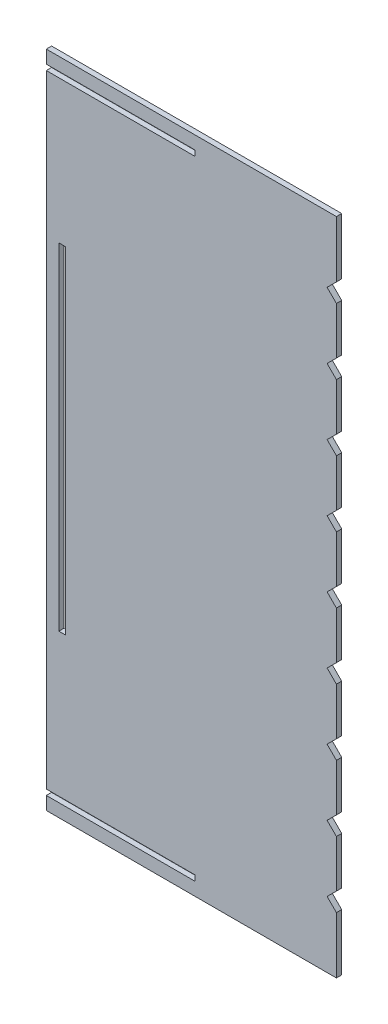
from build123d import *

# Parameters (mm, degrees)
MODEL_W         = 5
MODEL_H         = 255
EXTRUDE_1_DEPTH = 4


with BuildPart() as part:
    # Model → Extrude 1 (new body)
    with BuildSketch(Plane.XY):
        Polygon((-1426.1818, -454.8997), (-1426.1818, -497.8287), (-1433.253, -504.8997), (-1426.1818, -511.9708), (-1426.1818, -547.8287), (-1433.253, -554.8997), (-1426.1818, -561.9708), (-1426.1818, -597.8286), (-1433.253, -604.8997), (-1426.1818, -611.9708), (-1426.1818, -647.8286), (-1433.253, -654.8997), (-1426.1818, -661.9708), (-1426.1818, -697.8286), (-1433.253, -704.8997), (-1426.1818, -711.9708), (-1426.1818, -747.8286), (-1433.253, -754.8997), (-1426.1818, -761.9708), (-1426.1818, -797.8286), (-1433.253, -804.8997), (-1426.1818, -811.9708), (-1426.1818, -847.8287), (-1433.253, -854.8997), (-1426.1818, -861.9708), (-1426.1818, -897.8287), (-1433.253, -904.8997), (-1426.1818, -911.9708), (-1426.1818, -954.8997), (-1646.1818, -954.8997), (-1646.1818, -944.9996), (-1533.3986, -944.9996), (-1533.3986, -944.8997), (-1533.3986, -940.8997), (-1533.3986, -940.7996), (-1646.1818, -940.7996), (-1646.1818, -468.9997), (-1533.3986, -468.9997), (-1533.3986, -468.8997), (-1533.3986, -464.8997), (-1533.3986, -464.7997), (-1646.1818, -464.7997), (-1646.1818, -454.8997), align=None)
        with Locations((-1634.1818, -704.8997)):
            Rectangle(MODEL_W, MODEL_H, mode=Mode.SUBTRACT)
    extrude(amount=EXTRUDE_1_DEPTH)


solid = part.part
